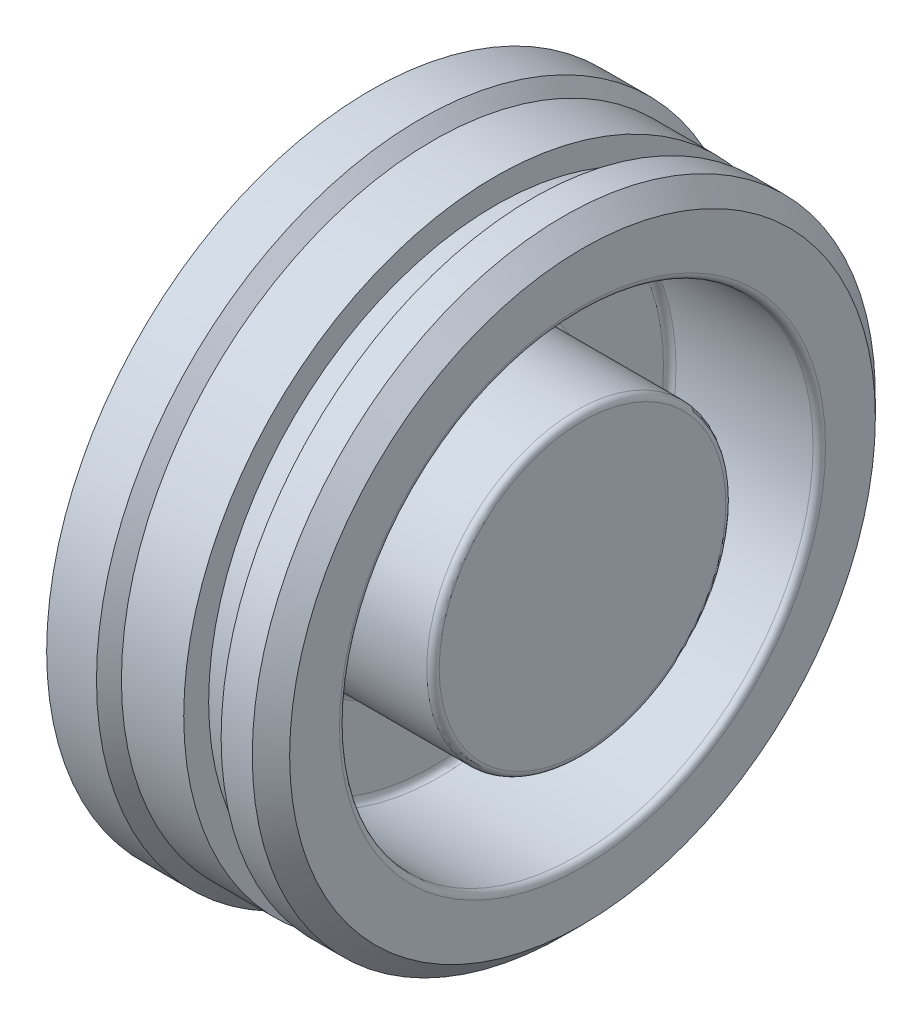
ISO-10303-21;
HEADER;
FILE_DESCRIPTION(('STEP AP214'),'2;1');
FILE_NAME('part.step','',(''),(''),'','','');
FILE_SCHEMA(('AUTOMOTIVE_DESIGN { 1 0 10303 214 1 1 1 1 }'));
ENDSEC;
DATA;
#1=APPLICATION_CONTEXT('core data for automotive mechanical design processes');
#2=APPLICATION_PROTOCOL_DEFINITION('international standard','automotive_design',2000,#1);
#3=PRODUCT_CONTEXT('',#1,'mechanical');
#4=PRODUCT('Part','Part','',(#3));
#5=PRODUCT_RELATED_PRODUCT_CATEGORY('part','',(#4));
#6=PRODUCT_DEFINITION_FORMATION('','',#4);
#7=PRODUCT_DEFINITION_CONTEXT('part definition',#1,'design');
#8=PRODUCT_DEFINITION('design','',#6,#7);
#9=PRODUCT_DEFINITION_SHAPE('','',#8);
#10=(LENGTH_UNIT() NAMED_UNIT(*) SI_UNIT(.MILLI.,.METRE.));
#11=(NAMED_UNIT(*) PLANE_ANGLE_UNIT() SI_UNIT($,.RADIAN.));
#12=(NAMED_UNIT(*) SI_UNIT($,.STERADIAN.) SOLID_ANGLE_UNIT());
#13=UNCERTAINTY_MEASURE_WITH_UNIT(LENGTH_MEASURE(1.E-05),#10,'distance_accuracy_value','');
#14=(GEOMETRIC_REPRESENTATION_CONTEXT(3) GLOBAL_UNCERTAINTY_ASSIGNED_CONTEXT((#13)) GLOBAL_UNIT_ASSIGNED_CONTEXT((#10,
#11,#12)) REPRESENTATION_CONTEXT('',''));
#15=CARTESIAN_POINT('',(0.,0.,0.));
#16=DIRECTION('',(0.,0.,1.));
#17=DIRECTION('',(1.,0.,0.));
#18=AXIS2_PLACEMENT_3D('',#15,#16,#17);
#19=CARTESIAN_POINT('',(-72.7479695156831,0.,0.));
#20=DIRECTION('',(-1.,0.,0.));
#21=DIRECTION('',(0.,0.,1.));
#22=AXIS2_PLACEMENT_3D('',#19,#20,#21);
#23=CYLINDRICAL_SURFACE('',#22,12.5);
#24=CARTESIAN_POINT('',(-57.5,0.,0.));
#25=DIRECTION('',(-1.,0.,0.));
#26=DIRECTION('',(0.,0.,1.));
#27=AXIS2_PLACEMENT_3D('',#24,#25,#26);
#28=CIRCLE('',#27,12.5);
#29=CARTESIAN_POINT('',(-57.5,0.,12.5));
#30=VERTEX_POINT('',#29);
#31=EDGE_CURVE('E63',#30,#30,#28,.T.);
#32=ORIENTED_EDGE('',*,*,#31,.F.);
#33=EDGE_LOOP('',(#32));
#34=FACE_BOUND('',#33,.T.);
#35=CARTESIAN_POINT('',(-55.,0.,0.));
#36=DIRECTION('',(-1.,0.,0.));
#37=DIRECTION('',(0.,0.,1.));
#38=AXIS2_PLACEMENT_3D('',#35,#36,#37);
#39=CIRCLE('',#38,12.5);
#40=CARTESIAN_POINT('',(-55.,0.,12.5));
#41=VERTEX_POINT('',#40);
#42=EDGE_CURVE('E81',#41,#41,#39,.T.);
#43=ORIENTED_EDGE('',*,*,#42,.T.);
#44=EDGE_LOOP('',(#43));
#45=FACE_BOUND('',#44,.T.);
#46=ADVANCED_FACE('F26',(#34,#45),#23,.T.);
#47=CARTESIAN_POINT('',(-57.5,0.,0.));
#48=DIRECTION('',(-1.,0.,0.));
#49=DIRECTION('',(0.,0.,1.));
#50=AXIS2_PLACEMENT_3D('',#47,#48,#49);
#51=CONICAL_SURFACE('',#50,12.5,0.785398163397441);
#52=CARTESIAN_POINT('',(-58.,0.,0.));
#53=DIRECTION('',(-1.,0.,0.));
#54=DIRECTION('',(0.,0.,1.));
#55=AXIS2_PLACEMENT_3D('',#52,#53,#54);
#56=CIRCLE('',#55,13.);
#57=CARTESIAN_POINT('',(-58.,0.,13.));
#58=VERTEX_POINT('',#57);
#59=EDGE_CURVE('E66',#58,#58,#56,.T.);
#60=ORIENTED_EDGE('',*,*,#59,.F.);
#61=EDGE_LOOP('',(#60));
#62=FACE_BOUND('',#61,.T.);
#63=ORIENTED_EDGE('',*,*,#31,.T.);
#64=EDGE_LOOP('',(#63));
#65=FACE_BOUND('',#64,.T.);
#66=ADVANCED_FACE('F118',(#62,#65),#51,.T.);
#67=CARTESIAN_POINT('',(-72.7479695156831,0.,0.));
#68=DIRECTION('',(-1.,0.,0.));
#69=DIRECTION('',(0.,0.,1.));
#70=AXIS2_PLACEMENT_3D('',#67,#68,#69);
#71=CYLINDRICAL_SURFACE('',#70,13.);
#72=CARTESIAN_POINT('',(-60.,0.,0.));
#73=DIRECTION('',(-1.,0.,0.));
#74=DIRECTION('',(0.,0.,1.));
#75=AXIS2_PLACEMENT_3D('',#72,#73,#74);
#76=CIRCLE('',#75,13.);
#77=CARTESIAN_POINT('',(-60.,0.,13.));
#78=VERTEX_POINT('',#77);
#79=EDGE_CURVE('E69',#78,#78,#76,.T.);
#80=ORIENTED_EDGE('',*,*,#79,.F.);
#81=EDGE_LOOP('',(#80));
#82=FACE_BOUND('',#81,.T.);
#83=ORIENTED_EDGE('',*,*,#59,.T.);
#84=EDGE_LOOP('',(#83));
#85=FACE_BOUND('',#84,.T.);
#86=ADVANCED_FACE('F123',(#82,#85),#71,.T.);
#87=CARTESIAN_POINT('',(-60.,13.,0.));
#88=DIRECTION('',(1.,0.,0.));
#89=DIRECTION('',(0.,0.,-1.));
#90=AXIS2_PLACEMENT_3D('',#87,#88,#89);
#91=PLANE('',#90);
#92=ORIENTED_EDGE('',*,*,#79,.T.);
#93=EDGE_LOOP('',(#92));
#94=FACE_BOUND('',#93,.T.);
#95=ADVANCED_FACE('F113',(#94),#91,.F.);
#96=CARTESIAN_POINT('',(-51.5,12.5,0.));
#97=DIRECTION('',(-1.,0.,0.));
#98=DIRECTION('',(0.,0.,1.));
#99=AXIS2_PLACEMENT_3D('',#96,#97,#98);
#100=PLANE('',#99);
#101=CARTESIAN_POINT('',(-51.5,0.,0.));
#102=DIRECTION('',(-1.,0.,0.));
#103=DIRECTION('',(0.,0.,1.));
#104=AXIS2_PLACEMENT_3D('',#101,#102,#103);
#105=CIRCLE('',#104,9.75);
#106=CARTESIAN_POINT('',(-51.5,0.,9.75));
#107=VERTEX_POINT('',#106);
#108=EDGE_CURVE('E48',#107,#107,#105,.T.);
#109=ORIENTED_EDGE('',*,*,#108,.T.);
#110=EDGE_LOOP('',(#109));
#111=FACE_BOUND('',#110,.T.);
#112=CARTESIAN_POINT('',(-51.5,0.,0.));
#113=DIRECTION('',(-1.,0.,0.));
#114=DIRECTION('',(0.,0.,1.));
#115=AXIS2_PLACEMENT_3D('',#112,#113,#114);
#116=CIRCLE('',#115,11.75);
#117=CARTESIAN_POINT('',(-51.5,0.,11.75));
#118=VERTEX_POINT('',#117);
#119=EDGE_CURVE('E57',#118,#118,#116,.F.);
#120=ORIENTED_EDGE('',*,*,#119,.T.);
#121=EDGE_LOOP('',(#120));
#122=FACE_BOUND('',#121,.T.);
#123=ADVANCED_FACE('F107',(#111,#122),#100,.F.);
#124=CARTESIAN_POINT('',(-72.7479695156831,0.,0.));
#125=DIRECTION('',(-1.,0.,0.));
#126=DIRECTION('',(0.,0.,1.));
#127=AXIS2_PLACEMENT_3D('',#124,#125,#126);
#128=CYLINDRICAL_SURFACE('',#127,12.5);
#129=CARTESIAN_POINT('',(-52.25,0.,0.));
#130=DIRECTION('',(-1.,0.,0.));
#131=DIRECTION('',(0.,0.,1.));
#132=AXIS2_PLACEMENT_3D('',#129,#130,#131);
#133=CIRCLE('',#132,12.5);
#134=CARTESIAN_POINT('',(-52.25,0.,12.5));
#135=VERTEX_POINT('',#134);
#136=EDGE_CURVE('E60',#135,#135,#133,.T.);
#137=ORIENTED_EDGE('',*,*,#136,.T.);
#138=EDGE_LOOP('',(#137));
#139=FACE_BOUND('',#138,.T.);
#140=CARTESIAN_POINT('',(-53.5,0.,0.));
#141=DIRECTION('',(-1.,0.,0.));
#142=DIRECTION('',(0.,0.,1.));
#143=AXIS2_PLACEMENT_3D('',#140,#141,#142);
#144=CIRCLE('',#143,12.5);
#145=CARTESIAN_POINT('',(-53.5,0.,12.5));
#146=VERTEX_POINT('',#145);
#147=EDGE_CURVE('E72',#146,#146,#144,.T.);
#148=ORIENTED_EDGE('',*,*,#147,.F.);
#149=EDGE_LOOP('',(#148));
#150=FACE_BOUND('',#149,.T.);
#151=ADVANCED_FACE('F102',(#139,#150),#128,.T.);
#152=CARTESIAN_POINT('',(-53.5,11.5,0.));
#153=DIRECTION('',(1.,0.,0.));
#154=DIRECTION('',(0.,0.,-1.));
#155=AXIS2_PLACEMENT_3D('',#152,#153,#154);
#156=PLANE('',#155);
#157=CARTESIAN_POINT('',(-53.5,0.,0.));
#158=DIRECTION('',(-1.,0.,0.));
#159=DIRECTION('',(0.,0.,1.));
#160=AXIS2_PLACEMENT_3D('',#157,#158,#159);
#161=CIRCLE('',#160,11.5);
#162=CARTESIAN_POINT('',(-53.5,0.,11.5));
#163=VERTEX_POINT('',#162);
#164=EDGE_CURVE('E75',#163,#163,#161,.T.);
#165=ORIENTED_EDGE('',*,*,#164,.F.);
#166=EDGE_LOOP('',(#165));
#167=FACE_BOUND('',#166,.T.);
#168=ORIENTED_EDGE('',*,*,#147,.T.);
#169=EDGE_LOOP('',(#168));
#170=FACE_BOUND('',#169,.T.);
#171=ADVANCED_FACE('F96',(#167,#170),#156,.F.);
#172=CARTESIAN_POINT('',(-72.7479695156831,0.,0.));
#173=DIRECTION('',(-1.,0.,0.));
#174=DIRECTION('',(0.,0.,1.));
#175=AXIS2_PLACEMENT_3D('',#172,#173,#174);
#176=CYLINDRICAL_SURFACE('',#175,11.5);
#177=CARTESIAN_POINT('',(-55.,0.,0.));
#178=DIRECTION('',(-1.,0.,0.));
#179=DIRECTION('',(0.,0.,1.));
#180=AXIS2_PLACEMENT_3D('',#177,#178,#179);
#181=CIRCLE('',#180,11.5);
#182=CARTESIAN_POINT('',(-55.,0.,11.5));
#183=VERTEX_POINT('',#182);
#184=EDGE_CURVE('E78',#183,#183,#181,.T.);
#185=ORIENTED_EDGE('',*,*,#184,.F.);
#186=EDGE_LOOP('',(#185));
#187=FACE_BOUND('',#186,.T.);
#188=ORIENTED_EDGE('',*,*,#164,.T.);
#189=EDGE_LOOP('',(#188));
#190=FACE_BOUND('',#189,.T.);
#191=ADVANCED_FACE('F90',(#187,#190),#176,.T.);
#192=CARTESIAN_POINT('',(-55.,12.5,0.));
#193=DIRECTION('',(-1.,0.,0.));
#194=DIRECTION('',(0.,0.,1.));
#195=AXIS2_PLACEMENT_3D('',#192,#193,#194);
#196=PLANE('',#195);
#197=ORIENTED_EDGE('',*,*,#42,.F.);
#198=EDGE_LOOP('',(#197));
#199=FACE_BOUND('',#198,.T.);
#200=ORIENTED_EDGE('',*,*,#184,.T.);
#201=EDGE_LOOP('',(#200));
#202=FACE_BOUND('',#201,.T.);
#203=ADVANCED_FACE('F86',(#199,#202),#196,.F.);
#204=CARTESIAN_POINT('',(-52.25,0.,0.));
#205=DIRECTION('',(-1.,0.,0.));
#206=DIRECTION('',(0.,0.,1.));
#207=AXIS2_PLACEMENT_3D('',#204,#205,#206);
#208=CONICAL_SURFACE('',#207,12.5,0.785398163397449);
#209=ORIENTED_EDGE('',*,*,#119,.F.);
#210=EDGE_LOOP('',(#209));
#211=FACE_BOUND('',#210,.T.);
#212=ORIENTED_EDGE('',*,*,#136,.F.);
#213=EDGE_LOOP('',(#212));
#214=FACE_BOUND('',#213,.T.);
#215=ADVANCED_FACE('F89',(#211,#214),#208,.T.);
#216=CARTESIAN_POINT('',(-57.5,0.,0.));
#217=DIRECTION('',(1.,0.,0.));
#218=DIRECTION('',(0.,0.,-1.));
#219=AXIS2_PLACEMENT_3D('',#216,#217,#218);
#220=CYLINDRICAL_SURFACE('',#219,9.5);
#221=CARTESIAN_POINT('',(-51.75,0.,0.));
#222=DIRECTION('',(-1.,0.,0.));
#223=DIRECTION('',(0.,0.,1.));
#224=AXIS2_PLACEMENT_3D('',#221,#222,#223);
#225=CIRCLE('',#224,9.5);
#226=CARTESIAN_POINT('',(-51.75,0.,9.5));
#227=VERTEX_POINT('',#226);
#228=EDGE_CURVE('E51',#227,#227,#225,.F.);
#229=ORIENTED_EDGE('',*,*,#228,.T.);
#230=EDGE_LOOP('',(#229));
#231=FACE_BOUND('',#230,.T.);
#232=CARTESIAN_POINT('',(-57.25,0.,0.));
#233=DIRECTION('',(1.,0.,0.));
#234=DIRECTION('',(0.,0.,-1.));
#235=AXIS2_PLACEMENT_3D('',#232,#233,#234);
#236=CIRCLE('',#235,9.5);
#237=CARTESIAN_POINT('',(-57.25,0.,-9.5));
#238=VERTEX_POINT('',#237);
#239=EDGE_CURVE('E54',#238,#238,#236,.F.);
#240=ORIENTED_EDGE('',*,*,#239,.T.);
#241=EDGE_LOOP('',(#240));
#242=FACE_BOUND('',#241,.T.);
#243=ADVANCED_FACE('F177',(#231,#242),#220,.F.);
#244=CARTESIAN_POINT('',(-57.5,0.,0.));
#245=DIRECTION('',(1.,0.,0.));
#246=DIRECTION('',(0.,0.,-1.));
#247=AXIS2_PLACEMENT_3D('',#244,#245,#246);
#248=PLANE('',#247);
#249=CARTESIAN_POINT('',(-57.5,0.,0.));
#250=DIRECTION('',(1.,0.,0.));
#251=DIRECTION('',(0.,0.,-1.));
#252=AXIS2_PLACEMENT_3D('',#249,#250,#251);
#253=CIRCLE('',#252,9.25);
#254=CARTESIAN_POINT('',(-57.5,0.,-9.25));
#255=VERTEX_POINT('',#254);
#256=EDGE_CURVE('E40',#255,#255,#253,.T.);
#257=ORIENTED_EDGE('',*,*,#256,.T.);
#258=EDGE_LOOP('',(#257));
#259=FACE_BOUND('',#258,.T.);
#260=CARTESIAN_POINT('',(-57.5,0.,0.));
#261=DIRECTION('',(1.,0.,0.));
#262=DIRECTION('',(0.,0.,-1.));
#263=AXIS2_PLACEMENT_3D('',#260,#261,#262);
#264=CIRCLE('',#263,6.25);
#265=CARTESIAN_POINT('',(-57.5,0.,-6.25));
#266=VERTEX_POINT('',#265);
#267=EDGE_CURVE('E45',#266,#266,#264,.F.);
#268=ORIENTED_EDGE('',*,*,#267,.T.);
#269=EDGE_LOOP('',(#268));
#270=FACE_BOUND('',#269,.T.);
#271=ADVANCED_FACE('F188',(#259,#270),#248,.T.);
#272=CARTESIAN_POINT('',(-57.5,0.,0.));
#273=DIRECTION('',(1.,0.,0.));
#274=DIRECTION('',(0.,0.,-1.));
#275=AXIS2_PLACEMENT_3D('',#272,#273,#274);
#276=CYLINDRICAL_SURFACE('',#275,6.);
#277=CARTESIAN_POINT('',(-57.25,0.,0.));
#278=DIRECTION('',(1.,0.,0.));
#279=DIRECTION('',(0.,0.,-1.));
#280=AXIS2_PLACEMENT_3D('',#277,#278,#279);
#281=CIRCLE('',#280,6.);
#282=CARTESIAN_POINT('',(-57.25,0.,-6.));
#283=VERTEX_POINT('',#282);
#284=EDGE_CURVE('E32',#283,#283,#281,.T.);
#285=ORIENTED_EDGE('',*,*,#284,.T.);
#286=EDGE_LOOP('',(#285));
#287=FACE_BOUND('',#286,.T.);
#288=CARTESIAN_POINT('',(-51.75,0.,0.));
#289=DIRECTION('',(-1.,0.,0.));
#290=DIRECTION('',(0.,0.,1.));
#291=AXIS2_PLACEMENT_3D('',#288,#289,#290);
#292=CIRCLE('',#291,6.);
#293=CARTESIAN_POINT('',(-51.75,0.,6.));
#294=VERTEX_POINT('',#293);
#295=EDGE_CURVE('E36',#294,#294,#292,.T.);
#296=ORIENTED_EDGE('',*,*,#295,.T.);
#297=EDGE_LOOP('',(#296));
#298=FACE_BOUND('',#297,.T.);
#299=ADVANCED_FACE('F198',(#287,#298),#276,.T.);
#300=CARTESIAN_POINT('',(-51.5,0.,0.));
#301=DIRECTION('',(-1.,0.,0.));
#302=DIRECTION('',(0.,0.,1.));
#303=AXIS2_PLACEMENT_3D('',#300,#301,#302);
#304=CIRCLE('',#303,5.75);
#305=CARTESIAN_POINT('',(-51.5,0.,5.75));
#306=VERTEX_POINT('',#305);
#307=EDGE_CURVE('E10',#306,#306,#304,.F.);
#308=ORIENTED_EDGE('',*,*,#307,.T.);
#309=EDGE_LOOP('',(#308));
#310=FACE_BOUND('',#309,.T.);
#311=ADVANCED_FACE('F116',(#310),#100,.F.);
#312=CARTESIAN_POINT('',(-51.75,0.,0.));
#313=DIRECTION('',(-1.,0.,0.));
#314=DIRECTION('',(0.,0.,1.));
#315=AXIS2_PLACEMENT_3D('',#312,#313,#314);
#316=TOROIDAL_SURFACE('',#315,9.75,0.25);
#317=ORIENTED_EDGE('',*,*,#108,.F.);
#318=EDGE_LOOP('',(#317));
#319=FACE_BOUND('',#318,.T.);
#320=ORIENTED_EDGE('',*,*,#228,.F.);
#321=EDGE_LOOP('',(#320));
#322=FACE_BOUND('',#321,.T.);
#323=ADVANCED_FACE('F216',(#319,#322),#316,.T.);
#324=CARTESIAN_POINT('',(-57.25,0.,0.));
#325=DIRECTION('',(1.,0.,0.));
#326=DIRECTION('',(0.,0.,-1.));
#327=AXIS2_PLACEMENT_3D('',#324,#325,#326);
#328=TOROIDAL_SURFACE('',#327,9.25,0.25);
#329=ORIENTED_EDGE('',*,*,#239,.F.);
#330=EDGE_LOOP('',(#329));
#331=FACE_BOUND('',#330,.T.);
#332=ORIENTED_EDGE('',*,*,#256,.F.);
#333=EDGE_LOOP('',(#332));
#334=FACE_BOUND('',#333,.T.);
#335=ADVANCED_FACE('F223',(#331,#334),#328,.F.);
#336=CARTESIAN_POINT('',(-57.25,0.,0.));
#337=DIRECTION('',(1.,0.,0.));
#338=DIRECTION('',(0.,0.,-1.));
#339=AXIS2_PLACEMENT_3D('',#336,#337,#338);
#340=TOROIDAL_SURFACE('',#339,6.25,0.25);
#341=ORIENTED_EDGE('',*,*,#267,.F.);
#342=EDGE_LOOP('',(#341));
#343=FACE_BOUND('',#342,.T.);
#344=ORIENTED_EDGE('',*,*,#284,.F.);
#345=EDGE_LOOP('',(#344));
#346=FACE_BOUND('',#345,.T.);
#347=ADVANCED_FACE('F233',(#343,#346),#340,.F.);
#348=CARTESIAN_POINT('',(-51.75,0.,0.));
#349=DIRECTION('',(-1.,0.,0.));
#350=DIRECTION('',(0.,0.,1.));
#351=AXIS2_PLACEMENT_3D('',#348,#349,#350);
#352=TOROIDAL_SURFACE('',#351,5.75,0.25);
#353=ORIENTED_EDGE('',*,*,#295,.F.);
#354=EDGE_LOOP('',(#353));
#355=FACE_BOUND('',#354,.T.);
#356=ORIENTED_EDGE('',*,*,#307,.F.);
#357=EDGE_LOOP('',(#356));
#358=FACE_BOUND('',#357,.T.);
#359=ADVANCED_FACE('F243',(#355,#358),#352,.T.);
#360=CLOSED_SHELL('',(#46,#66,#86,#95,#123,#151,#171,#191,#203,#215,#243,#271,#299,#311,#323,
#335,#347,#359));
#361=MANIFOLD_SOLID_BREP('B2',#360);
#362=ADVANCED_BREP_SHAPE_REPRESENTATION('',(#18,#361),#14);
#363=SHAPE_DEFINITION_REPRESENTATION(#9,#362);
ENDSEC;
END-ISO-10303-21;
